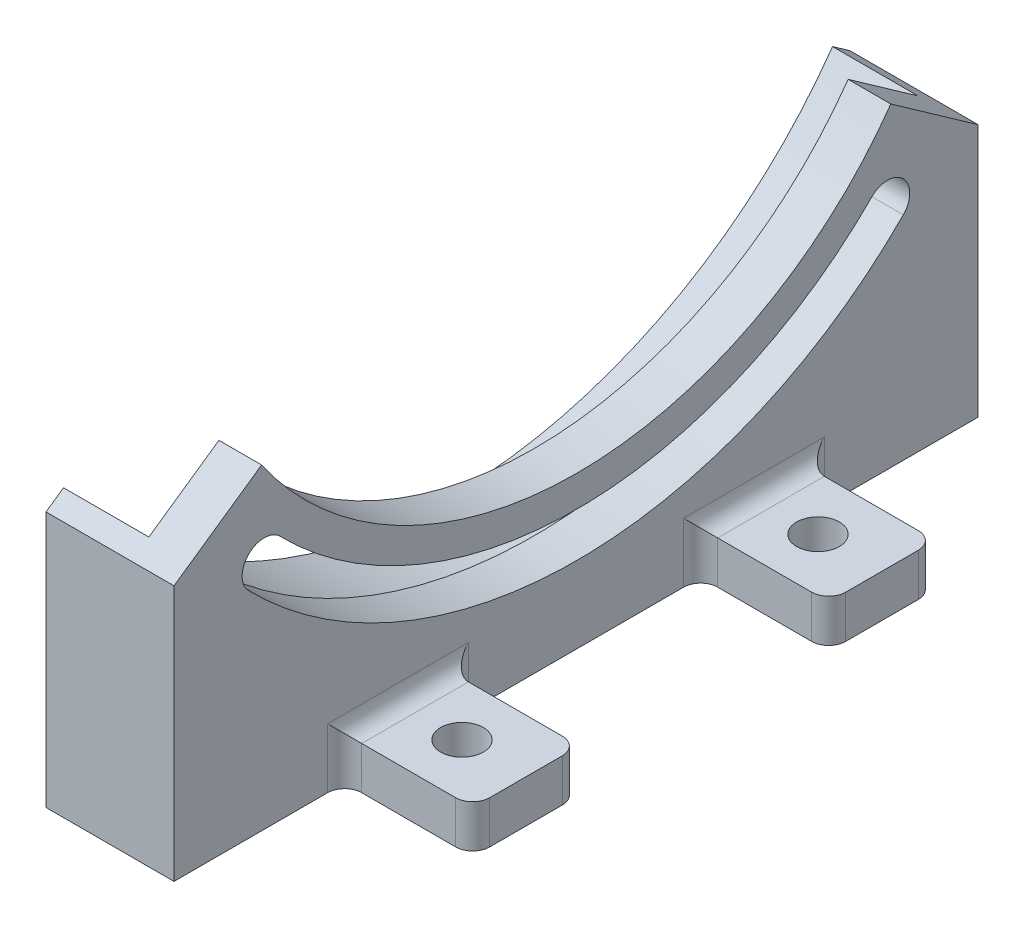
ISO-10303-21;
HEADER;
FILE_DESCRIPTION(('STEP AP214'),'2;1');
FILE_NAME('part.step','',(''),(''),'','','');
FILE_SCHEMA(('AUTOMOTIVE_DESIGN { 1 0 10303 214 1 1 1 1 }'));
ENDSEC;
DATA;
#1=APPLICATION_CONTEXT('core data for automotive mechanical design processes');
#2=APPLICATION_PROTOCOL_DEFINITION('international standard','automotive_design',2000,#1);
#3=PRODUCT_CONTEXT('',#1,'mechanical');
#4=PRODUCT('Part','Part','',(#3));
#5=PRODUCT_RELATED_PRODUCT_CATEGORY('part','',(#4));
#6=PRODUCT_DEFINITION_FORMATION('','',#4);
#7=PRODUCT_DEFINITION_CONTEXT('part definition',#1,'design');
#8=PRODUCT_DEFINITION('design','',#6,#7);
#9=PRODUCT_DEFINITION_SHAPE('','',#8);
#10=(LENGTH_UNIT() NAMED_UNIT(*) SI_UNIT(.MILLI.,.METRE.));
#11=(NAMED_UNIT(*) PLANE_ANGLE_UNIT() SI_UNIT($,.RADIAN.));
#12=(NAMED_UNIT(*) SI_UNIT($,.STERADIAN.) SOLID_ANGLE_UNIT());
#13=UNCERTAINTY_MEASURE_WITH_UNIT(LENGTH_MEASURE(1.E-05),#10,'distance_accuracy_value','');
#14=(GEOMETRIC_REPRESENTATION_CONTEXT(3) GLOBAL_UNCERTAINTY_ASSIGNED_CONTEXT((#13)) GLOBAL_UNIT_ASSIGNED_CONTEXT((#10,
#11,#12)) REPRESENTATION_CONTEXT('',''));
#15=CARTESIAN_POINT('',(0.,0.,0.));
#16=DIRECTION('',(0.,0.,1.));
#17=DIRECTION('',(1.,0.,0.));
#18=AXIS2_PLACEMENT_3D('',#15,#16,#17);
#19=CARTESIAN_POINT('',(0.,0.,0.));
#20=DIRECTION('',(1.,0.,0.));
#21=DIRECTION('',(0.,0.,-1.));
#22=AXIS2_PLACEMENT_3D('',#19,#20,#21);
#23=PLANE('',#22);
#24=CARTESIAN_POINT('',(0.,-45.8109888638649,-46.2356567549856));
#25=DIRECTION('',(1.,0.,0.));
#26=DIRECTION('',(0.,0.,-1.));
#27=AXIS2_PLACEMENT_3D('',#24,#25,#26);
#28=CIRCLE('',#27,3.302);
#29=CARTESIAN_POINT('',(0.,-48.1350585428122,-48.5812705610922));
#30=VERTEX_POINT('',#29);
#31=CARTESIAN_POINT('',(0.,-43.4869191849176,-43.890042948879));
#32=VERTEX_POINT('',#31);
#33=EDGE_CURVE('E282',#30,#32,#28,.T.);
#34=ORIENTED_EDGE('',*,*,#33,.T.);
#35=CARTESIAN_POINT('',(0.,0.,0.));
#36=DIRECTION('',(-1.,0.,0.));
#37=DIRECTION('',(0.,0.,-1.));
#38=AXIS2_PLACEMENT_3D('',#35,#36,#37);
#39=CIRCLE('',#38,61.7855);
#40=CARTESIAN_POINT('',(0.,-43.2059014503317,44.1667079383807));
#41=VERTEX_POINT('',#40);
#42=EDGE_CURVE('E273',#32,#41,#39,.T.);
#43=ORIENTED_EDGE('',*,*,#42,.T.);
#44=CARTESIAN_POINT('',(0.,-45.5149527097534,46.5271075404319));
#45=DIRECTION('',(1.,0.,0.));
#46=DIRECTION('',(0.,0.,-1.));
#47=AXIS2_PLACEMENT_3D('',#44,#45,#46);
#48=CIRCLE('',#47,3.302);
#49=CARTESIAN_POINT('',(0.,-47.824003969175,48.8875071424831));
#50=VERTEX_POINT('',#49);
#51=EDGE_CURVE('E280',#41,#50,#48,.T.);
#52=ORIENTED_EDGE('',*,*,#51,.T.);
#53=CARTESIAN_POINT('',(0.,0.,0.));
#54=DIRECTION('',(1.,0.,0.));
#55=DIRECTION('',(0.,0.,-1.));
#56=AXIS2_PLACEMENT_3D('',#53,#54,#55);
#57=CIRCLE('',#56,68.3895);
#58=EDGE_CURVE('E283',#50,#30,#57,.T.);
#59=ORIENTED_EDGE('',*,*,#58,.T.);
#60=EDGE_LOOP('',(#34,#43,#52,#59));
#61=FACE_BOUND('',#60,.T.);
#62=CARTESIAN_POINT('',(0.,0.,0.));
#63=DIRECTION('',(1.,0.,0.));
#64=DIRECTION('',(0.,0.,1.));
#65=AXIS2_PLACEMENT_3D('',#62,#63,#64);
#66=CIRCLE('',#65,69.85);
#67=CARTESIAN_POINT('',(0.,-39.8682843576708,57.3545325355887));
#68=VERTEX_POINT('',#67);
#69=CARTESIAN_POINT('',(0.,-40.2335424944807,-57.0989015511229));
#70=VERTEX_POINT('',#69);
#71=EDGE_CURVE('E260',#68,#70,#66,.T.);
#72=ORIENTED_EDGE('',*,*,#71,.F.);
#73=DIRECTION('',(0.,0.570769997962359,-0.82110998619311));
#74=VECTOR('',#73,1.);
#75=CARTESIAN_POINT('',(0.,-41.6804791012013,59.9615567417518));
#76=LINE('',#75,#74);
#77=CARTESIAN_POINT('',(0.,-32.6195053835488,46.9264357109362));
#78=VERTEX_POINT('',#77);
#79=EDGE_CURVE('E309',#68,#78,#76,.T.);
#80=ORIENTED_EDGE('',*,*,#79,.T.);
#81=CARTESIAN_POINT('',(0.,0.,0.));
#82=DIRECTION('',(1.,0.,0.));
#83=DIRECTION('',(0.,0.,-1.));
#84=AXIS2_PLACEMENT_3D('',#81,#82,#83);
#85=CIRCLE('',#84,57.15);
#86=CARTESIAN_POINT('',(0.,-32.9183529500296,-46.7172830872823));
#87=VERTEX_POINT('',#86);
#88=EDGE_CURVE('E297',#78,#87,#85,.T.);
#89=ORIENTED_EDGE('',*,*,#88,.T.);
#90=DIRECTION('',(0.,-0.575999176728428,-0.817450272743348));
#91=VECTOR('',#90,1.);
#92=CARTESIAN_POINT('',(0.,-32.9183529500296,-46.7172830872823));
#93=LINE('',#92,#91);
#94=EDGE_CURVE('E318',#87,#70,#93,.T.);
#95=ORIENTED_EDGE('',*,*,#94,.T.);
#96=EDGE_LOOP('',(#72,#80,#89,#95));
#97=FACE_BOUND('',#96,.T.);
#98=ADVANCED_FACE('F39',(#61,#97),#23,.F.);
#99=CARTESIAN_POINT('',(6.35,0.,0.));
#100=DIRECTION('',(-1.,0.,0.));
#101=DIRECTION('',(0.,0.,1.));
#102=AXIS2_PLACEMENT_3D('',#99,#100,#101);
#103=CYLINDRICAL_SURFACE('',#102,57.15);
#104=ORIENTED_EDGE('',*,*,#88,.F.);
#105=DIRECTION('',(-1.,0.,0.));
#106=VECTOR('',#105,1.);
#107=CARTESIAN_POINT('',(6.35,-32.6195053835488,46.9264357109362));
#108=LINE('',#107,#106);
#109=CARTESIAN_POINT('',(6.35,-32.6195053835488,46.9264357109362));
#110=VERTEX_POINT('',#109);
#111=EDGE_CURVE('E240',#110,#78,#108,.T.);
#112=ORIENTED_EDGE('',*,*,#111,.F.);
#113=CARTESIAN_POINT('',(6.35,0.,0.));
#114=DIRECTION('',(1.,0.,0.));
#115=DIRECTION('',(0.,0.,-1.));
#116=AXIS2_PLACEMENT_3D('',#113,#114,#115);
#117=CIRCLE('',#116,57.15);
#118=CARTESIAN_POINT('',(6.35,-32.9183529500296,-46.7172830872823));
#119=VERTEX_POINT('',#118);
#120=EDGE_CURVE('E308',#110,#119,#117,.T.);
#121=ORIENTED_EDGE('',*,*,#120,.T.);
#122=DIRECTION('',(-1.,0.,0.));
#123=VECTOR('',#122,1.);
#124=CARTESIAN_POINT('',(6.35,-32.9183529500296,-46.7172830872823));
#125=LINE('',#124,#123);
#126=EDGE_CURVE('E312',#119,#87,#125,.T.);
#127=ORIENTED_EDGE('',*,*,#126,.T.);
#128=EDGE_LOOP('',(#104,#112,#121,#127));
#129=FACE_BOUND('',#128,.T.);
#130=ADVANCED_FACE('F467',(#129),#103,.F.);
#131=CARTESIAN_POINT('',(6.35,-41.6804791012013,59.9615567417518));
#132=DIRECTION('',(0.,0.82110998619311,0.570769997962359));
#133=DIRECTION('',(0.,-0.570769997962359,0.82110998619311));
#134=AXIS2_PLACEMENT_3D('',#131,#132,#133);
#135=PLANE('',#134);
#136=ORIENTED_EDGE('',*,*,#79,.F.);
#137=DIRECTION('',(1.,0.,0.));
#138=VECTOR('',#137,1.);
#139=CARTESIAN_POINT('',(-12.7,-39.8682843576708,57.3545325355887));
#140=LINE('',#139,#138);
#141=CARTESIAN_POINT('',(-12.7,-39.8682843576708,57.3545325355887));
#142=VERTEX_POINT('',#141);
#143=EDGE_CURVE('E255',#142,#68,#140,.T.);
#144=ORIENTED_EDGE('',*,*,#143,.F.);
#145=DIRECTION('',(0.,0.570769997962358,-0.82110998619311));
#146=VECTOR('',#145,1.);
#147=CARTESIAN_POINT('',(-12.7,-41.6804791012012,59.9615567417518));
#148=LINE('',#147,#146);
#149=CARTESIAN_POINT('',(-12.7,-41.6804791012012,59.9615567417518));
#150=VERTEX_POINT('',#149);
#151=EDGE_CURVE('E242',#150,#142,#148,.T.);
#152=ORIENTED_EDGE('',*,*,#151,.F.);
#153=DIRECTION('',(-1.,0.,0.));
#154=VECTOR('',#153,1.);
#155=CARTESIAN_POINT('',(6.35,-41.6804791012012,59.9615567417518));
#156=LINE('',#155,#154);
#157=CARTESIAN_POINT('',(6.35,-41.6804791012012,59.9615567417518));
#158=VERTEX_POINT('',#157);
#159=EDGE_CURVE('E230',#158,#150,#156,.T.);
#160=ORIENTED_EDGE('',*,*,#159,.F.);
#161=DIRECTION('',(0.,0.570769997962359,-0.82110998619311));
#162=VECTOR('',#161,1.);
#163=CARTESIAN_POINT('',(6.35,-41.6804791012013,59.9615567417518));
#164=LINE('',#163,#162);
#165=EDGE_CURVE('E311',#158,#110,#164,.T.);
#166=ORIENTED_EDGE('',*,*,#165,.T.);
#167=ORIENTED_EDGE('',*,*,#111,.T.);
#168=EDGE_LOOP('',(#136,#144,#152,#160,#166,#167));
#169=FACE_BOUND('',#168,.T.);
#170=ADVANCED_FACE('F252',(#169),#135,.T.);
#171=CARTESIAN_POINT('',(6.35,-32.9183529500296,-46.7172830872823));
#172=DIRECTION('',(0.,0.817450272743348,-0.575999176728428));
#173=DIRECTION('',(0.,0.575999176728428,0.817450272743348));
#174=AXIS2_PLACEMENT_3D('',#171,#172,#173);
#175=PLANE('',#174);
#176=ORIENTED_EDGE('',*,*,#94,.F.);
#177=ORIENTED_EDGE('',*,*,#126,.F.);
#178=DIRECTION('',(0.,-0.575999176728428,-0.817450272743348));
#179=VECTOR('',#178,1.);
#180=CARTESIAN_POINT('',(6.35,-32.9183529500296,-46.7172830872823));
#181=LINE('',#180,#179);
#182=CARTESIAN_POINT('',(6.35,-42.0623398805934,-59.694306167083));
#183=VERTEX_POINT('',#182);
#184=EDGE_CURVE('E310',#119,#183,#181,.T.);
#185=ORIENTED_EDGE('',*,*,#184,.T.);
#186=DIRECTION('',(-1.,0.,0.));
#187=VECTOR('',#186,1.);
#188=CARTESIAN_POINT('',(6.35,-42.0623398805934,-59.694306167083));
#189=LINE('',#188,#187);
#190=CARTESIAN_POINT('',(-12.7,-42.0623398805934,-59.694306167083));
#191=VERTEX_POINT('',#190);
#192=EDGE_CURVE('E236',#183,#191,#189,.T.);
#193=ORIENTED_EDGE('',*,*,#192,.T.);
#194=DIRECTION('',(0.,-0.575999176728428,-0.817450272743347));
#195=VECTOR('',#194,1.);
#196=CARTESIAN_POINT('',(-12.7,-42.0623398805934,-59.694306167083));
#197=LINE('',#196,#195);
#198=CARTESIAN_POINT('',(-12.7,-40.2335424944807,-57.0989015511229));
#199=VERTEX_POINT('',#198);
#200=EDGE_CURVE('E259',#199,#191,#197,.T.);
#201=ORIENTED_EDGE('',*,*,#200,.F.);
#202=DIRECTION('',(1.,0.,0.));
#203=VECTOR('',#202,1.);
#204=CARTESIAN_POINT('',(-12.7,-40.2335424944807,-57.0989015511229));
#205=LINE('',#204,#203);
#206=EDGE_CURVE('E268',#199,#70,#205,.T.);
#207=ORIENTED_EDGE('',*,*,#206,.T.);
#208=EDGE_LOOP('',(#176,#177,#185,#193,#201,#207));
#209=FACE_BOUND('',#208,.T.);
#210=ADVANCED_FACE('F476',(#209),#175,.T.);
#211=CARTESIAN_POINT('',(6.35,0.,0.));
#212=DIRECTION('',(1.,0.,0.));
#213=DIRECTION('',(0.,0.,-1.));
#214=AXIS2_PLACEMENT_3D('',#211,#212,#213);
#215=PLANE('',#214);
#216=DIRECTION('',(0.,0.,-1.));
#217=VECTOR('',#216,1.);
#218=CARTESIAN_POINT('',(6.35,-70.8904791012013,18.6865567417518));
#219=LINE('',#218,#217);
#220=CARTESIAN_POINT('',(6.35,-70.8904791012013,37.1015567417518));
#221=VERTEX_POINT('',#220);
#222=CARTESIAN_POINT('',(6.35,-70.8904791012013,16.1465567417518));
#223=VERTEX_POINT('',#222);
#224=EDGE_CURVE('E333',#221,#223,#219,.T.);
#225=ORIENTED_EDGE('',*,*,#224,.T.);
#226=DIRECTION('',(0.,-1.,0.));
#227=VECTOR('',#226,1.);
#228=CARTESIAN_POINT('',(6.35,-79.7804791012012,16.1465567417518));
#229=LINE('',#228,#227);
#230=CARTESIAN_POINT('',(6.35,-79.7804791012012,16.1465567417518));
#231=VERTEX_POINT('',#230);
#232=EDGE_CURVE('E336',#223,#231,#229,.T.);
#233=ORIENTED_EDGE('',*,*,#232,.T.);
#234=DIRECTION('',(0.,0.,-1.));
#235=VECTOR('',#234,1.);
#236=CARTESIAN_POINT('',(6.35,-79.7804791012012,59.9615567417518));
#237=LINE('',#236,#235);
#238=CARTESIAN_POINT('',(6.35,-79.7804791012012,-15.879306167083));
#239=VERTEX_POINT('',#238);
#240=EDGE_CURVE('E452',#231,#239,#237,.T.);
#241=ORIENTED_EDGE('',*,*,#240,.T.);
#242=DIRECTION('',(0.,-1.,0.));
#243=VECTOR('',#242,1.);
#244=CARTESIAN_POINT('',(6.35,-73.4304791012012,-15.879306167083));
#245=LINE('',#244,#243);
#246=CARTESIAN_POINT('',(6.35,-70.8904791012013,-15.879306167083));
#247=VERTEX_POINT('',#246);
#248=EDGE_CURVE('E325',#239,#247,#245,.F.);
#249=ORIENTED_EDGE('',*,*,#248,.T.);
#250=DIRECTION('',(0.,0.,-1.));
#251=VECTOR('',#250,1.);
#252=CARTESIAN_POINT('',(6.35,-70.8904791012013,-34.294306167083));
#253=LINE('',#252,#251);
#254=CARTESIAN_POINT('',(6.35,-70.8904791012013,-36.834306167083));
#255=VERTEX_POINT('',#254);
#256=EDGE_CURVE('E327',#247,#255,#253,.T.);
#257=ORIENTED_EDGE('',*,*,#256,.T.);
#258=DIRECTION('',(0.,-1.,0.));
#259=VECTOR('',#258,1.);
#260=CARTESIAN_POINT('',(6.35,-79.7804791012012,-36.834306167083));
#261=LINE('',#260,#259);
#262=CARTESIAN_POINT('',(6.35,-79.7804791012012,-36.834306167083));
#263=VERTEX_POINT('',#262);
#264=EDGE_CURVE('E332',#255,#263,#261,.T.);
#265=ORIENTED_EDGE('',*,*,#264,.T.);
#266=CARTESIAN_POINT('',(6.35,-79.7804791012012,-59.694306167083));
#267=VERTEX_POINT('',#266);
#268=EDGE_CURVE('E449',#263,#267,#237,.T.);
#269=ORIENTED_EDGE('',*,*,#268,.T.);
#270=DIRECTION('',(0.,1.,0.));
#271=VECTOR('',#270,1.);
#272=CARTESIAN_POINT('',(6.35,-79.7804791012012,-59.694306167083));
#273=LINE('',#272,#271);
#274=EDGE_CURVE('E248',#267,#183,#273,.T.);
#275=ORIENTED_EDGE('',*,*,#274,.T.);
#276=ORIENTED_EDGE('',*,*,#184,.F.);
#277=ORIENTED_EDGE('',*,*,#120,.F.);
#278=ORIENTED_EDGE('',*,*,#165,.F.);
#279=DIRECTION('',(0.,-1.,0.));
#280=VECTOR('',#279,1.);
#281=CARTESIAN_POINT('',(6.35,-41.6804791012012,59.9615567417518));
#282=LINE('',#281,#280);
#283=CARTESIAN_POINT('',(6.35,-79.7804791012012,59.9615567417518));
#284=VERTEX_POINT('',#283);
#285=EDGE_CURVE('E231',#158,#284,#282,.T.);
#286=ORIENTED_EDGE('',*,*,#285,.T.);
#287=CARTESIAN_POINT('',(6.35,-79.7804791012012,37.1015567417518));
#288=VERTEX_POINT('',#287);
#289=EDGE_CURVE('E451',#284,#288,#237,.T.);
#290=ORIENTED_EDGE('',*,*,#289,.T.);
#291=DIRECTION('',(0.,-1.,0.));
#292=VECTOR('',#291,1.);
#293=CARTESIAN_POINT('',(6.35,-73.4304791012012,37.1015567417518));
#294=LINE('',#293,#292);
#295=EDGE_CURVE('E334',#288,#221,#294,.F.);
#296=ORIENTED_EDGE('',*,*,#295,.T.);
#297=EDGE_LOOP('',(#225,#233,#241,#249,#257,#265,#269,#275,#276,#277,#278,#286,#290,#296));
#298=FACE_BOUND('',#297,.T.);
#299=CARTESIAN_POINT('',(6.35,0.,0.));
#300=DIRECTION('',(-1.,0.,0.));
#301=DIRECTION('',(0.,0.,-1.));
#302=AXIS2_PLACEMENT_3D('',#299,#300,#301);
#303=CIRCLE('',#302,61.7855);
#304=CARTESIAN_POINT('',(6.35,-43.4869191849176,-43.890042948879));
#305=VERTEX_POINT('',#304);
#306=CARTESIAN_POINT('',(6.35,-43.2059014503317,44.1667079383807));
#307=VERTEX_POINT('',#306);
#308=EDGE_CURVE('E272',#305,#307,#303,.T.);
#309=ORIENTED_EDGE('',*,*,#308,.F.);
#310=CARTESIAN_POINT('',(6.35,-45.8109888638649,-46.2356567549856));
#311=DIRECTION('',(1.,0.,0.));
#312=DIRECTION('',(0.,0.,-1.));
#313=AXIS2_PLACEMENT_3D('',#310,#311,#312);
#314=CIRCLE('',#313,3.302);
#315=CARTESIAN_POINT('',(6.35,-48.1350585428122,-48.5812705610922));
#316=VERTEX_POINT('',#315);
#317=EDGE_CURVE('E279',#316,#305,#314,.T.);
#318=ORIENTED_EDGE('',*,*,#317,.F.);
#319=CARTESIAN_POINT('',(6.35,0.,0.));
#320=DIRECTION('',(1.,0.,0.));
#321=DIRECTION('',(0.,0.,-1.));
#322=AXIS2_PLACEMENT_3D('',#319,#320,#321);
#323=CIRCLE('',#322,68.3895);
#324=CARTESIAN_POINT('',(6.35,-47.824003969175,48.8875071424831));
#325=VERTEX_POINT('',#324);
#326=EDGE_CURVE('E295',#325,#316,#323,.T.);
#327=ORIENTED_EDGE('',*,*,#326,.F.);
#328=CARTESIAN_POINT('',(6.35,-45.5149527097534,46.5271075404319));
#329=DIRECTION('',(1.,0.,0.));
#330=DIRECTION('',(0.,0.,-1.));
#331=AXIS2_PLACEMENT_3D('',#328,#329,#330);
#332=CIRCLE('',#331,3.302);
#333=EDGE_CURVE('E288',#307,#325,#332,.T.);
#334=ORIENTED_EDGE('',*,*,#333,.F.);
#335=EDGE_LOOP('',(#309,#318,#327,#334));
#336=FACE_BOUND('',#335,.T.);
#337=ADVANCED_FACE('F462',(#298,#336),#215,.T.);
#338=CARTESIAN_POINT('',(0.,0.,0.));
#339=DIRECTION('',(1.,0.,0.));
#340=DIRECTION('',(0.,0.,-1.));
#341=AXIS2_PLACEMENT_3D('',#338,#339,#340);
#342=CYLINDRICAL_SURFACE('',#341,61.7855);
#343=ORIENTED_EDGE('',*,*,#308,.T.);
#344=DIRECTION('',(1.,0.,0.));
#345=VECTOR('',#344,1.);
#346=CARTESIAN_POINT('',(0.,-43.2059014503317,44.1667079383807));
#347=LINE('',#346,#345);
#348=EDGE_CURVE('E286',#41,#307,#347,.T.);
#349=ORIENTED_EDGE('',*,*,#348,.F.);
#350=ORIENTED_EDGE('',*,*,#42,.F.);
#351=DIRECTION('',(1.,0.,0.));
#352=VECTOR('',#351,1.);
#353=CARTESIAN_POINT('',(0.,-43.4869191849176,-43.890042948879));
#354=LINE('',#353,#352);
#355=EDGE_CURVE('E300',#32,#305,#354,.T.);
#356=ORIENTED_EDGE('',*,*,#355,.T.);
#357=EDGE_LOOP('',(#343,#349,#350,#356));
#358=FACE_BOUND('',#357,.T.);
#359=ADVANCED_FACE('F649',(#358),#342,.T.);
#360=CARTESIAN_POINT('',(0.,-45.8109888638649,-46.2356567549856));
#361=DIRECTION('',(1.,0.,0.));
#362=DIRECTION('',(0.,0.,-1.));
#363=AXIS2_PLACEMENT_3D('',#360,#361,#362);
#364=CYLINDRICAL_SURFACE('',#363,3.302);
#365=ORIENTED_EDGE('',*,*,#317,.T.);
#366=ORIENTED_EDGE('',*,*,#355,.F.);
#367=ORIENTED_EDGE('',*,*,#33,.F.);
#368=DIRECTION('',(1.,0.,0.));
#369=VECTOR('',#368,1.);
#370=CARTESIAN_POINT('',(0.,-48.1350585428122,-48.5812705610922));
#371=LINE('',#370,#369);
#372=EDGE_CURVE('E299',#30,#316,#371,.T.);
#373=ORIENTED_EDGE('',*,*,#372,.T.);
#374=EDGE_LOOP('',(#365,#366,#367,#373));
#375=FACE_BOUND('',#374,.T.);
#376=ADVANCED_FACE('F817',(#375),#364,.F.);
#377=CARTESIAN_POINT('',(0.,0.,0.));
#378=DIRECTION('',(1.,0.,0.));
#379=DIRECTION('',(0.,0.,-1.));
#380=AXIS2_PLACEMENT_3D('',#377,#378,#379);
#381=CYLINDRICAL_SURFACE('',#380,68.3895);
#382=ORIENTED_EDGE('',*,*,#326,.T.);
#383=ORIENTED_EDGE('',*,*,#372,.F.);
#384=ORIENTED_EDGE('',*,*,#58,.F.);
#385=DIRECTION('',(1.,0.,0.));
#386=VECTOR('',#385,1.);
#387=CARTESIAN_POINT('',(0.,-47.824003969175,48.8875071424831));
#388=LINE('',#387,#386);
#389=EDGE_CURVE('E301',#50,#325,#388,.T.);
#390=ORIENTED_EDGE('',*,*,#389,.T.);
#391=EDGE_LOOP('',(#382,#383,#384,#390));
#392=FACE_BOUND('',#391,.T.);
#393=ADVANCED_FACE('F807',(#392),#381,.F.);
#394=CARTESIAN_POINT('',(0.,-45.5149527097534,46.5271075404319));
#395=DIRECTION('',(1.,0.,0.));
#396=DIRECTION('',(0.,0.,-1.));
#397=AXIS2_PLACEMENT_3D('',#394,#395,#396);
#398=CYLINDRICAL_SURFACE('',#397,3.302);
#399=ORIENTED_EDGE('',*,*,#333,.T.);
#400=ORIENTED_EDGE('',*,*,#389,.F.);
#401=ORIENTED_EDGE('',*,*,#51,.F.);
#402=ORIENTED_EDGE('',*,*,#348,.T.);
#403=EDGE_LOOP('',(#399,#400,#401,#402));
#404=FACE_BOUND('',#403,.T.);
#405=ADVANCED_FACE('F799',(#404),#398,.F.);
#406=CARTESIAN_POINT('',(-12.7,0.,0.));
#407=DIRECTION('',(1.,0.,0.));
#408=DIRECTION('',(0.,0.,-1.));
#409=AXIS2_PLACEMENT_3D('',#406,#407,#408);
#410=CYLINDRICAL_SURFACE('',#409,69.85);
#411=ORIENTED_EDGE('',*,*,#71,.T.);
#412=ORIENTED_EDGE('',*,*,#206,.F.);
#413=CARTESIAN_POINT('',(-12.7,0.,0.));
#414=DIRECTION('',(1.,0.,0.));
#415=DIRECTION('',(0.,0.,1.));
#416=AXIS2_PLACEMENT_3D('',#413,#414,#415);
#417=CIRCLE('',#416,69.85);
#418=EDGE_CURVE('E258',#142,#199,#417,.T.);
#419=ORIENTED_EDGE('',*,*,#418,.F.);
#420=ORIENTED_EDGE('',*,*,#143,.T.);
#421=EDGE_LOOP('',(#411,#412,#419,#420));
#422=FACE_BOUND('',#421,.T.);
#423=ADVANCED_FACE('F474',(#422),#410,.F.);
#424=CARTESIAN_POINT('',(-12.7,0.,0.));
#425=DIRECTION('',(-1.,0.,0.));
#426=DIRECTION('',(0.,0.,1.));
#427=AXIS2_PLACEMENT_3D('',#424,#425,#426);
#428=PLANE('',#427);
#429=ORIENTED_EDGE('',*,*,#200,.T.);
#430=DIRECTION('',(0.,1.,0.));
#431=VECTOR('',#430,1.);
#432=CARTESIAN_POINT('',(-12.7,-79.7804791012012,-59.694306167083));
#433=LINE('',#432,#431);
#434=CARTESIAN_POINT('',(-12.7,-79.7804791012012,-59.694306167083));
#435=VERTEX_POINT('',#434);
#436=EDGE_CURVE('E450',#435,#191,#433,.T.);
#437=ORIENTED_EDGE('',*,*,#436,.F.);
#438=DIRECTION('',(0.,0.,-1.));
#439=VECTOR('',#438,1.);
#440=CARTESIAN_POINT('',(-12.7,-79.7804791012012,59.9615567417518));
#441=LINE('',#440,#439);
#442=CARTESIAN_POINT('',(-12.7,-79.7804791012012,59.9615567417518));
#443=VERTEX_POINT('',#442);
#444=EDGE_CURVE('E250',#443,#435,#441,.T.);
#445=ORIENTED_EDGE('',*,*,#444,.F.);
#446=DIRECTION('',(0.,-1.,0.));
#447=VECTOR('',#446,1.);
#448=CARTESIAN_POINT('',(-12.7,-41.6804791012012,59.9615567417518));
#449=LINE('',#448,#447);
#450=EDGE_CURVE('E229',#150,#443,#449,.T.);
#451=ORIENTED_EDGE('',*,*,#450,.F.);
#452=ORIENTED_EDGE('',*,*,#151,.T.);
#453=ORIENTED_EDGE('',*,*,#418,.T.);
#454=EDGE_LOOP('',(#429,#437,#445,#451,#452,#453));
#455=FACE_BOUND('',#454,.T.);
#456=ADVANCED_FACE('F241',(#455),#428,.T.);
#457=CARTESIAN_POINT('',(-12.7,-79.7804791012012,-59.694306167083));
#458=DIRECTION('',(0.,0.,-1.));
#459=DIRECTION('',(0.,1.,0.));
#460=AXIS2_PLACEMENT_3D('',#457,#458,#459);
#461=PLANE('',#460);
#462=ORIENTED_EDGE('',*,*,#274,.F.);
#463=DIRECTION('',(1.,0.,0.));
#464=VECTOR('',#463,1.);
#465=CARTESIAN_POINT('',(-12.7,-79.7804791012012,-59.694306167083));
#466=LINE('',#465,#464);
#467=EDGE_CURVE('E265',#435,#267,#466,.T.);
#468=ORIENTED_EDGE('',*,*,#467,.F.);
#469=ORIENTED_EDGE('',*,*,#436,.T.);
#470=ORIENTED_EDGE('',*,*,#192,.F.);
#471=EDGE_LOOP('',(#462,#468,#469,#470));
#472=FACE_BOUND('',#471,.T.);
#473=ADVANCED_FACE('F481',(#472),#461,.T.);
#474=CARTESIAN_POINT('',(-12.7,-79.7804791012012,59.9615567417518));
#475=DIRECTION('',(0.,-1.,0.));
#476=DIRECTION('',(0.,0.,-1.));
#477=AXIS2_PLACEMENT_3D('',#474,#475,#476);
#478=PLANE('',#477);
#479=DIRECTION('',(1.,0.,0.));
#480=VECTOR('',#479,1.);
#481=CARTESIAN_POINT('',(25.4,-79.7804791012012,-34.294306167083));
#482=LINE('',#481,#480);
#483=CARTESIAN_POINT('',(8.89,-79.7804791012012,-34.294306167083));
#484=VERTEX_POINT('',#483);
#485=CARTESIAN_POINT('',(22.86,-79.7804791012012,-34.294306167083));
#486=VERTEX_POINT('',#485);
#487=EDGE_CURVE('E426',#484,#486,#482,.T.);
#488=ORIENTED_EDGE('',*,*,#487,.T.);
#489=CARTESIAN_POINT('',(22.86,-79.7804791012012,-31.754306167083));
#490=DIRECTION('',(0.,-1.,0.));
#491=DIRECTION('',(0.,0.,-1.));
#492=AXIS2_PLACEMENT_3D('',#489,#490,#491);
#493=CIRCLE('',#492,2.54);
#494=CARTESIAN_POINT('',(25.4,-79.7804791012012,-31.754306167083));
#495=VERTEX_POINT('',#494);
#496=EDGE_CURVE('E372',#486,#495,#493,.T.);
#497=ORIENTED_EDGE('',*,*,#496,.T.);
#498=DIRECTION('',(0.,0.,1.));
#499=VECTOR('',#498,1.);
#500=CARTESIAN_POINT('',(25.4,-79.7804791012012,-18.419306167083));
#501=LINE('',#500,#499);
#502=CARTESIAN_POINT('',(25.4,-79.7804791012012,-20.959306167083));
#503=VERTEX_POINT('',#502);
#504=EDGE_CURVE('E421',#495,#503,#501,.T.);
#505=ORIENTED_EDGE('',*,*,#504,.T.);
#506=CARTESIAN_POINT('',(22.86,-79.7804791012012,-20.959306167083));
#507=DIRECTION('',(0.,-1.,0.));
#508=DIRECTION('',(0.,0.,-1.));
#509=AXIS2_PLACEMENT_3D('',#506,#507,#508);
#510=CIRCLE('',#509,2.54);
#511=CARTESIAN_POINT('',(22.86,-79.7804791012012,-18.419306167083));
#512=VERTEX_POINT('',#511);
#513=EDGE_CURVE('E375',#503,#512,#510,.T.);
#514=ORIENTED_EDGE('',*,*,#513,.T.);
#515=DIRECTION('',(-1.,0.,0.));
#516=VECTOR('',#515,1.);
#517=CARTESIAN_POINT('',(6.35,-79.7804791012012,-18.419306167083));
#518=LINE('',#517,#516);
#519=CARTESIAN_POINT('',(8.89,-79.7804791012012,-18.419306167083));
#520=VERTEX_POINT('',#519);
#521=EDGE_CURVE('E413',#512,#520,#518,.T.);
#522=ORIENTED_EDGE('',*,*,#521,.T.);
#523=CARTESIAN_POINT('',(8.89,-79.7804791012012,-15.879306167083));
#524=DIRECTION('',(0.,-1.,0.));
#525=DIRECTION('',(0.,0.,-1.));
#526=AXIS2_PLACEMENT_3D('',#523,#524,#525);
#527=CIRCLE('',#526,2.54);
#528=EDGE_CURVE('E11',#520,#239,#527,.F.);
#529=ORIENTED_EDGE('',*,*,#528,.T.);
#530=ORIENTED_EDGE('',*,*,#240,.F.);
#531=CARTESIAN_POINT('',(8.89,-79.7804791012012,16.1465567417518));
#532=DIRECTION('',(0.,-1.,0.));
#533=DIRECTION('',(0.,0.,-1.));
#534=AXIS2_PLACEMENT_3D('',#531,#532,#533);
#535=CIRCLE('',#534,2.54);
#536=CARTESIAN_POINT('',(8.89,-79.7804791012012,18.6865567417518));
#537=VERTEX_POINT('',#536);
#538=EDGE_CURVE('E390',#231,#537,#535,.F.);
#539=ORIENTED_EDGE('',*,*,#538,.T.);
#540=DIRECTION('',(1.,0.,0.));
#541=VECTOR('',#540,1.);
#542=CARTESIAN_POINT('',(25.4,-79.7804791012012,18.6865567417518));
#543=LINE('',#542,#541);
#544=CARTESIAN_POINT('',(22.86,-79.7804791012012,18.6865567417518));
#545=VERTEX_POINT('',#544);
#546=EDGE_CURVE('E497',#537,#545,#543,.T.);
#547=ORIENTED_EDGE('',*,*,#546,.T.);
#548=CARTESIAN_POINT('',(22.86,-79.7804791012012,21.2265567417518));
#549=DIRECTION('',(0.,-1.,0.));
#550=DIRECTION('',(0.,0.,-1.));
#551=AXIS2_PLACEMENT_3D('',#548,#549,#550);
#552=CIRCLE('',#551,2.54);
#553=CARTESIAN_POINT('',(25.4,-79.7804791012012,21.2265567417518));
#554=VERTEX_POINT('',#553);
#555=EDGE_CURVE('E62',#545,#554,#552,.T.);
#556=ORIENTED_EDGE('',*,*,#555,.T.);
#557=DIRECTION('',(0.,0.,1.));
#558=VECTOR('',#557,1.);
#559=CARTESIAN_POINT('',(25.4,-79.7804791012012,34.5615567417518));
#560=LINE('',#559,#558);
#561=CARTESIAN_POINT('',(25.4,-79.7804791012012,32.0215567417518));
#562=VERTEX_POINT('',#561);
#563=EDGE_CURVE('E518',#554,#562,#560,.T.);
#564=ORIENTED_EDGE('',*,*,#563,.T.);
#565=CARTESIAN_POINT('',(22.86,-79.7804791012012,32.0215567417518));
#566=DIRECTION('',(0.,-1.,0.));
#567=DIRECTION('',(0.,0.,-1.));
#568=AXIS2_PLACEMENT_3D('',#565,#566,#567);
#569=CIRCLE('',#568,2.54);
#570=CARTESIAN_POINT('',(22.86,-79.7804791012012,34.5615567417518));
#571=VERTEX_POINT('',#570);
#572=EDGE_CURVE('E57',#562,#571,#569,.T.);
#573=ORIENTED_EDGE('',*,*,#572,.T.);
#574=DIRECTION('',(-1.,0.,0.));
#575=VECTOR('',#574,1.);
#576=CARTESIAN_POINT('',(6.35,-79.7804791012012,34.5615567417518));
#577=LINE('',#576,#575);
#578=CARTESIAN_POINT('',(8.89,-79.7804791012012,34.5615567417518));
#579=VERTEX_POINT('',#578);
#580=EDGE_CURVE('E435',#571,#579,#577,.T.);
#581=ORIENTED_EDGE('',*,*,#580,.T.);
#582=CARTESIAN_POINT('',(8.89,-79.7804791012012,37.1015567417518));
#583=DIRECTION('',(0.,-1.,0.));
#584=DIRECTION('',(0.,0.,-1.));
#585=AXIS2_PLACEMENT_3D('',#582,#583,#584);
#586=CIRCLE('',#585,2.54);
#587=EDGE_CURVE('E48',#579,#288,#586,.F.);
#588=ORIENTED_EDGE('',*,*,#587,.T.);
#589=ORIENTED_EDGE('',*,*,#289,.F.);
#590=DIRECTION('',(1.,0.,0.));
#591=VECTOR('',#590,1.);
#592=CARTESIAN_POINT('',(-12.7,-79.7804791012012,59.9615567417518));
#593=LINE('',#592,#591);
#594=EDGE_CURVE('E264',#443,#284,#593,.T.);
#595=ORIENTED_EDGE('',*,*,#594,.F.);
#596=ORIENTED_EDGE('',*,*,#444,.T.);
#597=ORIENTED_EDGE('',*,*,#467,.T.);
#598=ORIENTED_EDGE('',*,*,#268,.F.);
#599=CARTESIAN_POINT('',(8.89,-79.7804791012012,-36.834306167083));
#600=DIRECTION('',(0.,-1.,0.));
#601=DIRECTION('',(0.,0.,-1.));
#602=AXIS2_PLACEMENT_3D('',#599,#600,#601);
#603=CIRCLE('',#602,2.54);
#604=EDGE_CURVE('E384',#263,#484,#603,.F.);
#605=ORIENTED_EDGE('',*,*,#604,.T.);
#606=EDGE_LOOP('',(#488,#497,#505,#514,#522,#529,#530,#539,#547,#556,#564,#573,#581,#588,#589,
#595,#596,#597,#598,#605));
#607=FACE_BOUND('',#606,.T.);
#608=CARTESIAN_POINT('',(15.875,-79.7804791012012,-26.356806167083));
#609=DIRECTION('',(0.,-1.,0.));
#610=DIRECTION('',(0.,0.,-1.));
#611=AXIS2_PLACEMENT_3D('',#608,#609,#610);
#612=CIRCLE('',#611,3.175);
#613=CARTESIAN_POINT('',(15.875,-79.7804791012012,-29.531806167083));
#614=VERTEX_POINT('',#613);
#615=EDGE_CURVE('E439',#614,#614,#612,.T.);
#616=ORIENTED_EDGE('',*,*,#615,.F.);
#617=EDGE_LOOP('',(#616));
#618=FACE_BOUND('',#617,.T.);
#619=CARTESIAN_POINT('',(15.875,-79.7804791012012,26.6240567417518));
#620=DIRECTION('',(0.,-1.,0.));
#621=DIRECTION('',(0.,0.,-1.));
#622=AXIS2_PLACEMENT_3D('',#619,#620,#621);
#623=CIRCLE('',#622,3.175);
#624=CARTESIAN_POINT('',(15.875,-79.7804791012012,23.4490567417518));
#625=VERTEX_POINT('',#624);
#626=EDGE_CURVE('E444',#625,#625,#623,.T.);
#627=ORIENTED_EDGE('',*,*,#626,.F.);
#628=EDGE_LOOP('',(#627));
#629=FACE_BOUND('',#628,.T.);
#630=ADVANCED_FACE('F416',(#607,#618,#629),#478,.T.);
#631=CARTESIAN_POINT('',(-12.7,-41.6804791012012,59.9615567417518));
#632=DIRECTION('',(0.,0.,1.));
#633=DIRECTION('',(0.,-1.,0.));
#634=AXIS2_PLACEMENT_3D('',#631,#632,#633);
#635=PLANE('',#634);
#636=ORIENTED_EDGE('',*,*,#285,.F.);
#637=ORIENTED_EDGE('',*,*,#159,.T.);
#638=ORIENTED_EDGE('',*,*,#450,.T.);
#639=ORIENTED_EDGE('',*,*,#594,.T.);
#640=EDGE_LOOP('',(#636,#637,#638,#639));
#641=FACE_BOUND('',#640,.T.);
#642=ADVANCED_FACE('F227',(#641),#635,.T.);
#643=CARTESIAN_POINT('',(6.35,-73.4304791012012,-18.419306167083));
#644=DIRECTION('',(0.,0.,1.));
#645=DIRECTION('',(1.,0.,0.));
#646=AXIS2_PLACEMENT_3D('',#643,#644,#645);
#647=PLANE('',#646);
#648=DIRECTION('',(-1.,0.,0.));
#649=VECTOR('',#648,1.);
#650=CARTESIAN_POINT('',(6.35,-73.4304791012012,-18.419306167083));
#651=LINE('',#650,#649);
#652=CARTESIAN_POINT('',(22.86,-73.4304791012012,-18.419306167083));
#653=VERTEX_POINT('',#652);
#654=CARTESIAN_POINT('',(8.89,-73.4304791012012,-18.419306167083));
#655=VERTEX_POINT('',#654);
#656=EDGE_CURVE('E392',#653,#655,#651,.T.);
#657=ORIENTED_EDGE('',*,*,#656,.T.);
#658=DIRECTION('',(0.,-1.,0.));
#659=VECTOR('',#658,1.);
#660=CARTESIAN_POINT('',(8.89,-79.7804791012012,-18.419306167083));
#661=LINE('',#660,#659);
#662=EDGE_CURVE('E366',#655,#520,#661,.T.);
#663=ORIENTED_EDGE('',*,*,#662,.T.);
#664=ORIENTED_EDGE('',*,*,#521,.F.);
#665=DIRECTION('',(0.,-1.,0.));
#666=VECTOR('',#665,1.);
#667=CARTESIAN_POINT('',(22.86,-73.4304791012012,-18.419306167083));
#668=LINE('',#667,#666);
#669=EDGE_CURVE('E368',#512,#653,#668,.F.);
#670=ORIENTED_EDGE('',*,*,#669,.T.);
#671=EDGE_LOOP('',(#657,#663,#664,#670));
#672=FACE_BOUND('',#671,.T.);
#673=ADVANCED_FACE('F415',(#672),#647,.T.);
#674=CARTESIAN_POINT('',(25.4,-73.4304791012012,-18.419306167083));
#675=DIRECTION('',(1.,0.,0.));
#676=DIRECTION('',(0.,0.,-1.));
#677=AXIS2_PLACEMENT_3D('',#674,#675,#676);
#678=PLANE('',#677);
#679=ORIENTED_EDGE('',*,*,#504,.F.);
#680=DIRECTION('',(0.,-1.,0.));
#681=VECTOR('',#680,1.);
#682=CARTESIAN_POINT('',(25.4,-73.4304791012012,-31.754306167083));
#683=LINE('',#682,#681);
#684=CARTESIAN_POINT('',(25.4,-73.4304791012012,-31.754306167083));
#685=VERTEX_POINT('',#684);
#686=EDGE_CURVE('E377',#495,#685,#683,.F.);
#687=ORIENTED_EDGE('',*,*,#686,.T.);
#688=DIRECTION('',(0.,0.,1.));
#689=VECTOR('',#688,1.);
#690=CARTESIAN_POINT('',(25.4,-73.4304791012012,-18.419306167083));
#691=LINE('',#690,#689);
#692=CARTESIAN_POINT('',(25.4,-73.4304791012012,-20.959306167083));
#693=VERTEX_POINT('',#692);
#694=EDGE_CURVE('E427',#685,#693,#691,.T.);
#695=ORIENTED_EDGE('',*,*,#694,.T.);
#696=DIRECTION('',(0.,-1.,0.));
#697=VECTOR('',#696,1.);
#698=CARTESIAN_POINT('',(25.4,-73.4304791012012,-20.959306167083));
#699=LINE('',#698,#697);
#700=EDGE_CURVE('E376',#693,#503,#699,.T.);
#701=ORIENTED_EDGE('',*,*,#700,.T.);
#702=EDGE_LOOP('',(#679,#687,#695,#701));
#703=FACE_BOUND('',#702,.T.);
#704=ADVANCED_FACE('F610',(#703),#678,.T.);
#705=CARTESIAN_POINT('',(25.4,-73.4304791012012,-34.294306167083));
#706=DIRECTION('',(0.,0.,-1.));
#707=DIRECTION('',(-1.,0.,0.));
#708=AXIS2_PLACEMENT_3D('',#705,#706,#707);
#709=PLANE('',#708);
#710=ORIENTED_EDGE('',*,*,#487,.F.);
#711=DIRECTION('',(0.,-1.,0.));
#712=VECTOR('',#711,1.);
#713=CARTESIAN_POINT('',(8.89,-73.4304791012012,-34.294306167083));
#714=LINE('',#713,#712);
#715=CARTESIAN_POINT('',(8.89,-73.4304791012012,-34.294306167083));
#716=VERTEX_POINT('',#715);
#717=EDGE_CURVE('E354',#484,#716,#714,.F.);
#718=ORIENTED_EDGE('',*,*,#717,.T.);
#719=DIRECTION('',(1.,0.,0.));
#720=VECTOR('',#719,1.);
#721=CARTESIAN_POINT('',(25.4,-73.4304791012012,-34.294306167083));
#722=LINE('',#721,#720);
#723=CARTESIAN_POINT('',(22.86,-73.4304791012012,-34.294306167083));
#724=VERTEX_POINT('',#723);
#725=EDGE_CURVE('E424',#716,#724,#722,.T.);
#726=ORIENTED_EDGE('',*,*,#725,.T.);
#727=DIRECTION('',(0.,-1.,0.));
#728=VECTOR('',#727,1.);
#729=CARTESIAN_POINT('',(22.86,-73.4304791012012,-34.294306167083));
#730=LINE('',#729,#728);
#731=EDGE_CURVE('E355',#724,#486,#730,.T.);
#732=ORIENTED_EDGE('',*,*,#731,.T.);
#733=EDGE_LOOP('',(#710,#718,#726,#732));
#734=FACE_BOUND('',#733,.T.);
#735=ADVANCED_FACE('F602',(#734),#709,.T.);
#736=CARTESIAN_POINT('',(0.,-73.4304791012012,0.));
#737=DIRECTION('',(0.,1.,0.));
#738=DIRECTION('',(0.,0.,1.));
#739=AXIS2_PLACEMENT_3D('',#736,#737,#738);
#740=PLANE('',#739);
#741=CARTESIAN_POINT('',(15.875,-73.4304791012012,-26.356806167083));
#742=DIRECTION('',(0.,-1.,0.));
#743=DIRECTION('',(0.,0.,-1.));
#744=AXIS2_PLACEMENT_3D('',#741,#742,#743);
#745=CIRCLE('',#744,3.175);
#746=CARTESIAN_POINT('',(15.875,-73.4304791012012,-29.531806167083));
#747=VERTEX_POINT('',#746);
#748=EDGE_CURVE('E436',#747,#747,#745,.T.);
#749=ORIENTED_EDGE('',*,*,#748,.T.);
#750=EDGE_LOOP('',(#749));
#751=FACE_BOUND('',#750,.T.);
#752=ORIENTED_EDGE('',*,*,#725,.F.);
#753=DIRECTION('',(0.,0.,-1.));
#754=VECTOR('',#753,1.);
#755=CARTESIAN_POINT('',(8.89,-73.4304791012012,-18.419306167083));
#756=LINE('',#755,#754);
#757=EDGE_CURVE('E348',#716,#655,#756,.F.);
#758=ORIENTED_EDGE('',*,*,#757,.T.);
#759=ORIENTED_EDGE('',*,*,#656,.F.);
#760=CARTESIAN_POINT('',(22.86,-73.4304791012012,-20.959306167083));
#761=DIRECTION('',(0.,1.,0.));
#762=DIRECTION('',(0.,0.,1.));
#763=AXIS2_PLACEMENT_3D('',#760,#761,#762);
#764=CIRCLE('',#763,2.54);
#765=EDGE_CURVE('E347',#653,#693,#764,.T.);
#766=ORIENTED_EDGE('',*,*,#765,.T.);
#767=ORIENTED_EDGE('',*,*,#694,.F.);
#768=CARTESIAN_POINT('',(22.86,-73.4304791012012,-31.754306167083));
#769=DIRECTION('',(0.,1.,0.));
#770=DIRECTION('',(0.,0.,1.));
#771=AXIS2_PLACEMENT_3D('',#768,#769,#770);
#772=CIRCLE('',#771,2.54);
#773=EDGE_CURVE('E346',#685,#724,#772,.T.);
#774=ORIENTED_EDGE('',*,*,#773,.T.);
#775=EDGE_LOOP('',(#752,#758,#759,#766,#767,#774));
#776=FACE_BOUND('',#775,.T.);
#777=ADVANCED_FACE('F607',(#751,#776),#740,.T.);
#778=CARTESIAN_POINT('',(15.875,-73.4304791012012,-26.356806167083));
#779=DIRECTION('',(0.,-1.,0.));
#780=DIRECTION('',(0.,0.,-1.));
#781=AXIS2_PLACEMENT_3D('',#778,#779,#780);
#782=CYLINDRICAL_SURFACE('',#781,3.175);
#783=ORIENTED_EDGE('',*,*,#748,.F.);
#784=EDGE_LOOP('',(#783));
#785=FACE_BOUND('',#784,.T.);
#786=ORIENTED_EDGE('',*,*,#615,.T.);
#787=EDGE_LOOP('',(#786));
#788=FACE_BOUND('',#787,.T.);
#789=ADVANCED_FACE('F597',(#785,#788),#782,.F.);
#790=CARTESIAN_POINT('',(6.35,-73.4304791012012,34.5615567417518));
#791=DIRECTION('',(0.,0.,1.));
#792=DIRECTION('',(1.,0.,0.));
#793=AXIS2_PLACEMENT_3D('',#790,#791,#792);
#794=PLANE('',#793);
#795=DIRECTION('',(-1.,0.,0.));
#796=VECTOR('',#795,1.);
#797=CARTESIAN_POINT('',(6.35,-73.4304791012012,34.5615567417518));
#798=LINE('',#797,#796);
#799=CARTESIAN_POINT('',(22.86,-73.4304791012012,34.5615567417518));
#800=VERTEX_POINT('',#799);
#801=CARTESIAN_POINT('',(8.89,-73.4304791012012,34.5615567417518));
#802=VERTEX_POINT('',#801);
#803=EDGE_CURVE('E454',#800,#802,#798,.T.);
#804=ORIENTED_EDGE('',*,*,#803,.T.);
#805=DIRECTION('',(0.,-1.,0.));
#806=VECTOR('',#805,1.);
#807=CARTESIAN_POINT('',(8.89,-79.7804791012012,34.5615567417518));
#808=LINE('',#807,#806);
#809=EDGE_CURVE('E365',#802,#579,#808,.T.);
#810=ORIENTED_EDGE('',*,*,#809,.T.);
#811=ORIENTED_EDGE('',*,*,#580,.F.);
#812=DIRECTION('',(0.,-1.,0.));
#813=VECTOR('',#812,1.);
#814=CARTESIAN_POINT('',(22.86,-73.4304791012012,34.5615567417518));
#815=LINE('',#814,#813);
#816=EDGE_CURVE('E362',#571,#800,#815,.F.);
#817=ORIENTED_EDGE('',*,*,#816,.T.);
#818=EDGE_LOOP('',(#804,#810,#811,#817));
#819=FACE_BOUND('',#818,.T.);
#820=ADVANCED_FACE('F513',(#819),#794,.T.);
#821=CARTESIAN_POINT('',(25.4,-73.4304791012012,34.5615567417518));
#822=DIRECTION('',(1.,0.,0.));
#823=DIRECTION('',(0.,0.,-1.));
#824=AXIS2_PLACEMENT_3D('',#821,#822,#823);
#825=PLANE('',#824);
#826=ORIENTED_EDGE('',*,*,#563,.F.);
#827=DIRECTION('',(0.,-1.,0.));
#828=VECTOR('',#827,1.);
#829=CARTESIAN_POINT('',(25.4,-73.4304791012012,21.2265567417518));
#830=LINE('',#829,#828);
#831=CARTESIAN_POINT('',(25.4,-73.4304791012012,21.2265567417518));
#832=VERTEX_POINT('',#831);
#833=EDGE_CURVE('E382',#554,#832,#830,.F.);
#834=ORIENTED_EDGE('',*,*,#833,.T.);
#835=DIRECTION('',(0.,0.,1.));
#836=VECTOR('',#835,1.);
#837=CARTESIAN_POINT('',(25.4,-73.4304791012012,34.5615567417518));
#838=LINE('',#837,#836);
#839=CARTESIAN_POINT('',(25.4,-73.4304791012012,32.0215567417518));
#840=VERTEX_POINT('',#839);
#841=EDGE_CURVE('E502',#832,#840,#838,.T.);
#842=ORIENTED_EDGE('',*,*,#841,.T.);
#843=DIRECTION('',(0.,-1.,0.));
#844=VECTOR('',#843,1.);
#845=CARTESIAN_POINT('',(25.4,-73.4304791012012,32.0215567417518));
#846=LINE('',#845,#844);
#847=EDGE_CURVE('E381',#840,#562,#846,.T.);
#848=ORIENTED_EDGE('',*,*,#847,.T.);
#849=EDGE_LOOP('',(#826,#834,#842,#848));
#850=FACE_BOUND('',#849,.T.);
#851=ADVANCED_FACE('F587',(#850),#825,.T.);
#852=CARTESIAN_POINT('',(25.4,-73.4304791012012,18.6865567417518));
#853=DIRECTION('',(0.,0.,-1.));
#854=DIRECTION('',(-1.,0.,0.));
#855=AXIS2_PLACEMENT_3D('',#852,#853,#854);
#856=PLANE('',#855);
#857=ORIENTED_EDGE('',*,*,#546,.F.);
#858=DIRECTION('',(0.,-1.,0.));
#859=VECTOR('',#858,1.);
#860=CARTESIAN_POINT('',(8.89,-73.4304791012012,18.6865567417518));
#861=LINE('',#860,#859);
#862=CARTESIAN_POINT('',(8.89,-73.4304791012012,18.6865567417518));
#863=VERTEX_POINT('',#862);
#864=EDGE_CURVE('E357',#537,#863,#861,.F.);
#865=ORIENTED_EDGE('',*,*,#864,.T.);
#866=DIRECTION('',(1.,0.,0.));
#867=VECTOR('',#866,1.);
#868=CARTESIAN_POINT('',(25.4,-73.4304791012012,18.6865567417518));
#869=LINE('',#868,#867);
#870=CARTESIAN_POINT('',(22.86,-73.4304791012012,18.6865567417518));
#871=VERTEX_POINT('',#870);
#872=EDGE_CURVE('E493',#863,#871,#869,.T.);
#873=ORIENTED_EDGE('',*,*,#872,.T.);
#874=DIRECTION('',(0.,-1.,0.));
#875=VECTOR('',#874,1.);
#876=CARTESIAN_POINT('',(22.86,-73.4304791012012,18.6865567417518));
#877=LINE('',#876,#875);
#878=EDGE_CURVE('E356',#871,#545,#877,.T.);
#879=ORIENTED_EDGE('',*,*,#878,.T.);
#880=EDGE_LOOP('',(#857,#865,#873,#879));
#881=FACE_BOUND('',#880,.T.);
#882=ADVANCED_FACE('F492',(#881),#856,.T.);
#883=CARTESIAN_POINT('',(0.,-73.4304791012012,0.));
#884=DIRECTION('',(0.,1.,0.));
#885=DIRECTION('',(0.,0.,1.));
#886=AXIS2_PLACEMENT_3D('',#883,#884,#885);
#887=PLANE('',#886);
#888=CARTESIAN_POINT('',(15.875,-73.4304791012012,26.6240567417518));
#889=DIRECTION('',(0.,-1.,0.));
#890=DIRECTION('',(0.,0.,-1.));
#891=AXIS2_PLACEMENT_3D('',#888,#889,#890);
#892=CIRCLE('',#891,3.175);
#893=CARTESIAN_POINT('',(15.875,-73.4304791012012,23.4490567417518));
#894=VERTEX_POINT('',#893);
#895=EDGE_CURVE('E520',#894,#894,#892,.T.);
#896=ORIENTED_EDGE('',*,*,#895,.T.);
#897=EDGE_LOOP('',(#896));
#898=FACE_BOUND('',#897,.T.);
#899=ORIENTED_EDGE('',*,*,#872,.F.);
#900=DIRECTION('',(0.,0.,-1.));
#901=VECTOR('',#900,1.);
#902=CARTESIAN_POINT('',(8.89,-73.4304791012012,34.5615567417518));
#903=LINE('',#902,#901);
#904=EDGE_CURVE('E343',#863,#802,#903,.F.);
#905=ORIENTED_EDGE('',*,*,#904,.T.);
#906=ORIENTED_EDGE('',*,*,#803,.F.);
#907=CARTESIAN_POINT('',(22.86,-73.4304791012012,32.0215567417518));
#908=DIRECTION('',(0.,1.,0.));
#909=DIRECTION('',(0.,0.,1.));
#910=AXIS2_PLACEMENT_3D('',#907,#908,#909);
#911=CIRCLE('',#910,2.54);
#912=EDGE_CURVE('E339',#800,#840,#911,.T.);
#913=ORIENTED_EDGE('',*,*,#912,.T.);
#914=ORIENTED_EDGE('',*,*,#841,.F.);
#915=CARTESIAN_POINT('',(22.86,-73.4304791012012,21.2265567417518));
#916=DIRECTION('',(0.,1.,0.));
#917=DIRECTION('',(0.,0.,1.));
#918=AXIS2_PLACEMENT_3D('',#915,#916,#917);
#919=CIRCLE('',#918,2.54);
#920=EDGE_CURVE('E341',#832,#871,#919,.T.);
#921=ORIENTED_EDGE('',*,*,#920,.T.);
#922=EDGE_LOOP('',(#899,#905,#906,#913,#914,#921));
#923=FACE_BOUND('',#922,.T.);
#924=ADVANCED_FACE('F496',(#898,#923),#887,.T.);
#925=CARTESIAN_POINT('',(15.875,-73.4304791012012,26.6240567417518));
#926=DIRECTION('',(0.,-1.,0.));
#927=DIRECTION('',(0.,0.,-1.));
#928=AXIS2_PLACEMENT_3D('',#925,#926,#927);
#929=CYLINDRICAL_SURFACE('',#928,3.175);
#930=ORIENTED_EDGE('',*,*,#895,.F.);
#931=EDGE_LOOP('',(#930));
#932=FACE_BOUND('',#931,.T.);
#933=ORIENTED_EDGE('',*,*,#626,.T.);
#934=EDGE_LOOP('',(#933));
#935=FACE_BOUND('',#934,.T.);
#936=ADVANCED_FACE('F530',(#932,#935),#929,.F.);
#937=CARTESIAN_POINT('',(8.89,-73.4304791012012,37.1015567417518));
#938=DIRECTION('',(0.,1.,0.));
#939=DIRECTION('',(0.,0.,1.));
#940=AXIS2_PLACEMENT_3D('',#937,#938,#939);
#941=CYLINDRICAL_SURFACE('',#940,2.54);
#942=ORIENTED_EDGE('',*,*,#587,.F.);
#943=ORIENTED_EDGE('',*,*,#809,.F.);
#944=CARTESIAN_POINT('',(8.89,-70.8904791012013,37.1015567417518));
#945=DIRECTION('',(0.,0.707106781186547,-0.707106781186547));
#946=DIRECTION('',(0.,0.707106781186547,0.707106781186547));
#947=AXIS2_PLACEMENT_3D('',#944,#945,#946);
#948=ELLIPSE('',#947,3.59210244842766,2.54);
#949=EDGE_CURVE('E395',#221,#802,#948,.F.);
#950=ORIENTED_EDGE('',*,*,#949,.F.);
#951=ORIENTED_EDGE('',*,*,#295,.F.);
#952=EDGE_LOOP('',(#942,#943,#950,#951));
#953=FACE_BOUND('',#952,.T.);
#954=ADVANCED_FACE('F515',(#953),#941,.F.);
#955=CARTESIAN_POINT('',(8.89,0.,16.1465567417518));
#956=DIRECTION('',(0.,1.,0.));
#957=DIRECTION('',(0.,0.,1.));
#958=AXIS2_PLACEMENT_3D('',#955,#956,#957);
#959=CYLINDRICAL_SURFACE('',#958,2.54);
#960=ORIENTED_EDGE('',*,*,#538,.F.);
#961=ORIENTED_EDGE('',*,*,#232,.F.);
#962=CARTESIAN_POINT('',(8.89,-70.8904791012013,16.1465567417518));
#963=DIRECTION('',(0.,0.707106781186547,0.707106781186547));
#964=DIRECTION('',(0.,0.707106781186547,-0.707106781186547));
#965=AXIS2_PLACEMENT_3D('',#962,#963,#964);
#966=ELLIPSE('',#965,3.59210244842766,2.54);
#967=EDGE_CURVE('E388',#863,#223,#966,.F.);
#968=ORIENTED_EDGE('',*,*,#967,.F.);
#969=ORIENTED_EDGE('',*,*,#864,.F.);
#970=EDGE_LOOP('',(#960,#961,#968,#969));
#971=FACE_BOUND('',#970,.T.);
#972=ADVANCED_FACE('F488',(#971),#959,.F.);
#973=CARTESIAN_POINT('',(8.89,-70.8904791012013,0.));
#974=DIRECTION('',(0.,0.,1.));
#975=DIRECTION('',(1.,0.,0.));
#976=AXIS2_PLACEMENT_3D('',#973,#974,#975);
#977=CYLINDRICAL_SURFACE('',#976,2.54);
#978=ORIENTED_EDGE('',*,*,#949,.T.);
#979=ORIENTED_EDGE('',*,*,#904,.F.);
#980=ORIENTED_EDGE('',*,*,#967,.T.);
#981=ORIENTED_EDGE('',*,*,#224,.F.);
#982=EDGE_LOOP('',(#978,#979,#980,#981));
#983=FACE_BOUND('',#982,.T.);
#984=ADVANCED_FACE('F506',(#983),#977,.F.);
#985=CARTESIAN_POINT('',(8.89,-73.4304791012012,-15.879306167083));
#986=DIRECTION('',(0.,1.,0.));
#987=DIRECTION('',(0.,0.,1.));
#988=AXIS2_PLACEMENT_3D('',#985,#986,#987);
#989=CYLINDRICAL_SURFACE('',#988,2.54);
#990=ORIENTED_EDGE('',*,*,#528,.F.);
#991=ORIENTED_EDGE('',*,*,#662,.F.);
#992=CARTESIAN_POINT('',(8.89,-70.8904791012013,-15.879306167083));
#993=DIRECTION('',(0.,0.707106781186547,-0.707106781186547));
#994=DIRECTION('',(0.,0.707106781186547,0.707106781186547));
#995=AXIS2_PLACEMENT_3D('',#992,#993,#994);
#996=ELLIPSE('',#995,3.59210244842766,2.54);
#997=EDGE_CURVE('E43',#247,#655,#996,.F.);
#998=ORIENTED_EDGE('',*,*,#997,.F.);
#999=ORIENTED_EDGE('',*,*,#248,.F.);
#1000=EDGE_LOOP('',(#990,#991,#998,#999));
#1001=FACE_BOUND('',#1000,.T.);
#1002=ADVANCED_FACE('F406',(#1001),#989,.F.);
#1003=CARTESIAN_POINT('',(8.89,0.,-36.834306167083));
#1004=DIRECTION('',(0.,1.,0.));
#1005=DIRECTION('',(0.,0.,1.));
#1006=AXIS2_PLACEMENT_3D('',#1003,#1004,#1005);
#1007=CYLINDRICAL_SURFACE('',#1006,2.54);
#1008=ORIENTED_EDGE('',*,*,#604,.F.);
#1009=ORIENTED_EDGE('',*,*,#264,.F.);
#1010=CARTESIAN_POINT('',(8.89,-70.8904791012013,-36.834306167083));
#1011=DIRECTION('',(0.,0.707106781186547,0.707106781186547));
#1012=DIRECTION('',(0.,0.707106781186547,-0.707106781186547));
#1013=AXIS2_PLACEMENT_3D('',#1010,#1011,#1012);
#1014=ELLIPSE('',#1013,3.59210244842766,2.54);
#1015=EDGE_CURVE('E394',#716,#255,#1014,.F.);
#1016=ORIENTED_EDGE('',*,*,#1015,.F.);
#1017=ORIENTED_EDGE('',*,*,#717,.F.);
#1018=EDGE_LOOP('',(#1008,#1009,#1016,#1017));
#1019=FACE_BOUND('',#1018,.T.);
#1020=ADVANCED_FACE('F568',(#1019),#1007,.F.);
#1021=CARTESIAN_POINT('',(8.89,-70.8904791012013,0.));
#1022=DIRECTION('',(0.,0.,1.));
#1023=DIRECTION('',(1.,0.,0.));
#1024=AXIS2_PLACEMENT_3D('',#1021,#1022,#1023);
#1025=CYLINDRICAL_SURFACE('',#1024,2.54);
#1026=ORIENTED_EDGE('',*,*,#997,.T.);
#1027=ORIENTED_EDGE('',*,*,#757,.F.);
#1028=ORIENTED_EDGE('',*,*,#1015,.T.);
#1029=ORIENTED_EDGE('',*,*,#256,.F.);
#1030=EDGE_LOOP('',(#1026,#1027,#1028,#1029));
#1031=FACE_BOUND('',#1030,.T.);
#1032=ADVANCED_FACE('F401',(#1031),#1025,.F.);
#1033=CARTESIAN_POINT('',(22.86,-73.4304791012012,-31.754306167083));
#1034=DIRECTION('',(0.,-1.,0.));
#1035=DIRECTION('',(0.,0.,-1.));
#1036=AXIS2_PLACEMENT_3D('',#1033,#1034,#1035);
#1037=CYLINDRICAL_SURFACE('',#1036,2.54);
#1038=ORIENTED_EDGE('',*,*,#773,.F.);
#1039=ORIENTED_EDGE('',*,*,#686,.F.);
#1040=ORIENTED_EDGE('',*,*,#496,.F.);
#1041=ORIENTED_EDGE('',*,*,#731,.F.);
#1042=EDGE_LOOP('',(#1038,#1039,#1040,#1041));
#1043=FACE_BOUND('',#1042,.T.);
#1044=ADVANCED_FACE('F569',(#1043),#1037,.T.);
#1045=CARTESIAN_POINT('',(22.86,-73.4304791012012,-20.959306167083));
#1046=DIRECTION('',(0.,-1.,0.));
#1047=DIRECTION('',(0.,0.,-1.));
#1048=AXIS2_PLACEMENT_3D('',#1045,#1046,#1047);
#1049=CYLINDRICAL_SURFACE('',#1048,2.54);
#1050=ORIENTED_EDGE('',*,*,#765,.F.);
#1051=ORIENTED_EDGE('',*,*,#669,.F.);
#1052=ORIENTED_EDGE('',*,*,#513,.F.);
#1053=ORIENTED_EDGE('',*,*,#700,.F.);
#1054=EDGE_LOOP('',(#1050,#1051,#1052,#1053));
#1055=FACE_BOUND('',#1054,.T.);
#1056=ADVANCED_FACE('F580',(#1055),#1049,.T.);
#1057=CARTESIAN_POINT('',(22.86,-73.4304791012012,21.2265567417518));
#1058=DIRECTION('',(0.,-1.,0.));
#1059=DIRECTION('',(0.,0.,-1.));
#1060=AXIS2_PLACEMENT_3D('',#1057,#1058,#1059);
#1061=CYLINDRICAL_SURFACE('',#1060,2.54);
#1062=ORIENTED_EDGE('',*,*,#920,.F.);
#1063=ORIENTED_EDGE('',*,*,#833,.F.);
#1064=ORIENTED_EDGE('',*,*,#555,.F.);
#1065=ORIENTED_EDGE('',*,*,#878,.F.);
#1066=EDGE_LOOP('',(#1062,#1063,#1064,#1065));
#1067=FACE_BOUND('',#1066,.T.);
#1068=ADVANCED_FACE('F583',(#1067),#1061,.T.);
#1069=CARTESIAN_POINT('',(22.86,-73.4304791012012,32.0215567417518));
#1070=DIRECTION('',(0.,-1.,0.));
#1071=DIRECTION('',(0.,0.,-1.));
#1072=AXIS2_PLACEMENT_3D('',#1069,#1070,#1071);
#1073=CYLINDRICAL_SURFACE('',#1072,2.54);
#1074=ORIENTED_EDGE('',*,*,#912,.F.);
#1075=ORIENTED_EDGE('',*,*,#816,.F.);
#1076=ORIENTED_EDGE('',*,*,#572,.F.);
#1077=ORIENTED_EDGE('',*,*,#847,.F.);
#1078=EDGE_LOOP('',(#1074,#1075,#1076,#1077));
#1079=FACE_BOUND('',#1078,.T.);
#1080=ADVANCED_FACE('F41',(#1079),#1073,.T.);
#1081=CLOSED_SHELL('',(#98,#130,#170,#210,#337,#359,#376,#393,#405,#423,#456,#473,#630,#642,
#673,#704,#735,#777,#789,#820,#851,#882,#924,#936,#954,#972,#984,#1002,#1020,#1032,#1044,#1056,
#1068,#1080));
#1082=MANIFOLD_SOLID_BREP('B2',#1081);
#1083=ADVANCED_BREP_SHAPE_REPRESENTATION('',(#18,#1082),#14);
#1084=SHAPE_DEFINITION_REPRESENTATION(#9,#1083);
ENDSEC;
END-ISO-10303-21;
